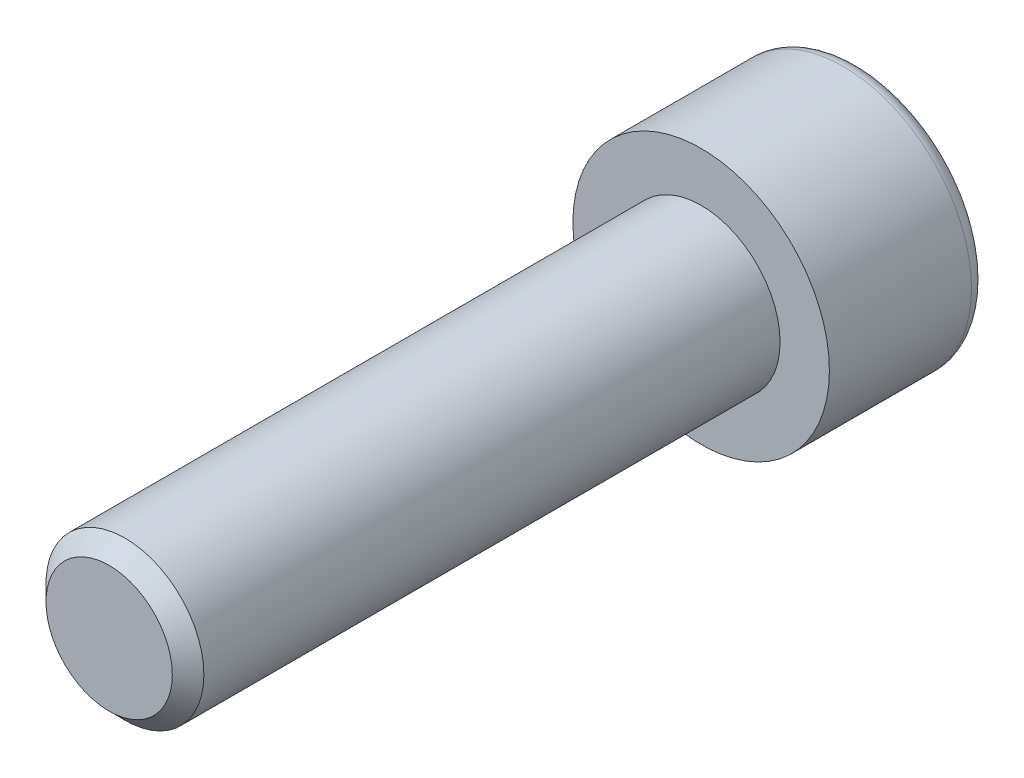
ISO-10303-21;
HEADER;
FILE_DESCRIPTION(('STEP AP214'),'2;1');
FILE_NAME('part.step','',(''),(''),'','','');
FILE_SCHEMA(('AUTOMOTIVE_DESIGN { 1 0 10303 214 1 1 1 1 }'));
ENDSEC;
DATA;
#1=APPLICATION_CONTEXT('core data for automotive mechanical design processes');
#2=APPLICATION_PROTOCOL_DEFINITION('international standard','automotive_design',2000,#1);
#3=PRODUCT_CONTEXT('',#1,'mechanical');
#4=PRODUCT('Part','Part','',(#3));
#5=PRODUCT_RELATED_PRODUCT_CATEGORY('part','',(#4));
#6=PRODUCT_DEFINITION_FORMATION('','',#4);
#7=PRODUCT_DEFINITION_CONTEXT('part definition',#1,'design');
#8=PRODUCT_DEFINITION('design','',#6,#7);
#9=PRODUCT_DEFINITION_SHAPE('','',#8);
#10=(LENGTH_UNIT() NAMED_UNIT(*) SI_UNIT(.MILLI.,.METRE.));
#11=(NAMED_UNIT(*) PLANE_ANGLE_UNIT() SI_UNIT($,.RADIAN.));
#12=(NAMED_UNIT(*) SI_UNIT($,.STERADIAN.) SOLID_ANGLE_UNIT());
#13=UNCERTAINTY_MEASURE_WITH_UNIT(LENGTH_MEASURE(1.E-05),#10,'distance_accuracy_value','');
#14=(GEOMETRIC_REPRESENTATION_CONTEXT(3) GLOBAL_UNCERTAINTY_ASSIGNED_CONTEXT((#13)) GLOBAL_UNIT_ASSIGNED_CONTEXT((#10,
#11,#12)) REPRESENTATION_CONTEXT('',''));
#15=CARTESIAN_POINT('',(0.,0.,0.));
#16=DIRECTION('',(0.,0.,1.));
#17=DIRECTION('',(1.,0.,0.));
#18=AXIS2_PLACEMENT_3D('',#15,#16,#17);
#19=CARTESIAN_POINT('',(0.,0.,-8.00000000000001));
#20=DIRECTION('',(0.,0.,1.));
#21=DIRECTION('',(1.00000000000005,0.,0.));
#22=AXIS2_PLACEMENT_3D('',#19,#20,#21);
#23=PLANE('',#22);
#24=CARTESIAN_POINT('',(0.,0.,-8.00000000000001));
#25=DIRECTION('',(0.,0.,-1.));
#26=DIRECTION('',(-1.00000000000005,0.,0.));
#27=AXIS2_PLACEMENT_3D('',#24,#25,#26);
#28=CIRCLE('',#27,5.7);
#29=CARTESIAN_POINT('',(-5.70000000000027,0.,-8.00000000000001));
#30=VERTEX_POINT('',#29);
#31=EDGE_CURVE('E145',#30,#30,#28,.T.);
#32=ORIENTED_EDGE('',*,*,#31,.T.);
#33=EDGE_LOOP('',(#32));
#34=FACE_BOUND('',#33,.T.);
#35=DIRECTION('',(-0.866025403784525,0.500000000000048,0.));
#36=VECTOR('',#35,1.);
#37=CARTESIAN_POINT('',(-1.52655665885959E-12,3.46410161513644,-8.00000000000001));
#38=LINE('',#37,#36);
#39=CARTESIAN_POINT('',(2.99999999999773,1.73205080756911,-8.00000000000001));
#40=VERTEX_POINT('',#39);
#41=CARTESIAN_POINT('',(-1.52655665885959E-12,3.46410161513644,-8.00000000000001));
#42=VERTEX_POINT('',#41);
#43=EDGE_CURVE('E49',#40,#42,#38,.T.);
#44=ORIENTED_EDGE('',*,*,#43,.T.);
#45=DIRECTION('',(-0.866025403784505,-0.500000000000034,0.));
#46=VECTOR('',#45,1.);
#47=CARTESIAN_POINT('',(-1.52655665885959E-12,3.46410161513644,-8.00000000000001));
#48=LINE('',#47,#46);
#49=CARTESIAN_POINT('',(-3.00000000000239,1.73205080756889,-8.00000000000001));
#50=VERTEX_POINT('',#49);
#51=EDGE_CURVE('E89',#42,#50,#48,.T.);
#52=ORIENTED_EDGE('',*,*,#51,.T.);
#53=DIRECTION('',(0.,-1.00000000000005,0.));
#54=VECTOR('',#53,1.);
#55=CARTESIAN_POINT('',(-3.00000000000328,-1.73205080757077,-8.00000000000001));
#56=LINE('',#55,#54);
#57=CARTESIAN_POINT('',(-3.00000000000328,-1.73205080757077,-8.00000000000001));
#58=VERTEX_POINT('',#57);
#59=EDGE_CURVE('E97',#50,#58,#56,.T.);
#60=ORIENTED_EDGE('',*,*,#59,.T.);
#61=DIRECTION('',(0.866025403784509,-0.500000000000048,0.));
#62=VECTOR('',#61,1.);
#63=CARTESIAN_POINT('',(-1.99840144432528E-12,-3.46410161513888,-8.00000000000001));
#64=LINE('',#63,#62);
#65=CARTESIAN_POINT('',(-1.99840144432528E-12,-3.46410161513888,-8.00000000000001));
#66=VERTEX_POINT('',#65);
#67=EDGE_CURVE('E115',#58,#66,#64,.T.);
#68=ORIENTED_EDGE('',*,*,#67,.T.);
#69=DIRECTION('',(0.866025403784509,0.500000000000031,0.));
#70=VECTOR('',#69,1.);
#71=CARTESIAN_POINT('',(-1.99840144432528E-12,-3.46410161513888,-8.00000000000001));
#72=LINE('',#71,#70);
#73=CARTESIAN_POINT('',(2.99999999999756,-1.732050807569,-8.00000000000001));
#74=VERTEX_POINT('',#73);
#75=EDGE_CURVE('E118',#66,#74,#72,.T.);
#76=ORIENTED_EDGE('',*,*,#75,.T.);
#77=DIRECTION('',(0.,1.00000000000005,0.));
#78=VECTOR('',#77,1.);
#79=CARTESIAN_POINT('',(2.99999999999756,-1.732050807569,-8.00000000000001));
#80=LINE('',#79,#78);
#81=EDGE_CURVE('E108',#74,#40,#80,.T.);
#82=ORIENTED_EDGE('',*,*,#81,.T.);
#83=EDGE_LOOP('',(#44,#52,#60,#68,#76,#82));
#84=FACE_BOUND('',#83,.T.);
#85=ADVANCED_FACE('F35',(#34,#84),#23,.F.);
#86=CARTESIAN_POINT('',(0.,0.,-7.19999999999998));
#87=DIRECTION('',(0.,0.,-1.));
#88=DIRECTION('',(-1.00000000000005,0.,0.));
#89=AXIS2_PLACEMENT_3D('',#86,#87,#88);
#90=TOROIDAL_SURFACE('',#89,5.7,0.8);
#91=ORIENTED_EDGE('',*,*,#31,.F.);
#92=EDGE_LOOP('',(#91));
#93=FACE_BOUND('',#92,.T.);
#94=CARTESIAN_POINT('',(0.,0.,-7.19999999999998));
#95=DIRECTION('',(0.,0.,-1.));
#96=DIRECTION('',(-1.00000000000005,0.,0.));
#97=AXIS2_PLACEMENT_3D('',#94,#95,#96);
#98=CIRCLE('',#97,6.5);
#99=CARTESIAN_POINT('',(-6.50000000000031,0.,-7.19999999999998));
#100=VERTEX_POINT('',#99);
#101=EDGE_CURVE('E142',#100,#100,#98,.T.);
#102=ORIENTED_EDGE('',*,*,#101,.T.);
#103=EDGE_LOOP('',(#102));
#104=FACE_BOUND('',#103,.T.);
#105=ADVANCED_FACE('F164',(#93,#104),#90,.T.);
#106=CARTESIAN_POINT('',(0.,0.,0.));
#107=DIRECTION('',(0.,0.,-1.));
#108=DIRECTION('',(-1.00000000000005,0.,0.));
#109=AXIS2_PLACEMENT_3D('',#106,#107,#108);
#110=CYLINDRICAL_SURFACE('',#109,6.5);
#111=ORIENTED_EDGE('',*,*,#101,.F.);
#112=EDGE_LOOP('',(#111));
#113=FACE_BOUND('',#112,.T.);
#114=CARTESIAN_POINT('',(0.,0.,0.));
#115=DIRECTION('',(0.,0.,-1.));
#116=DIRECTION('',(-1.00000000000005,0.,0.));
#117=AXIS2_PLACEMENT_3D('',#114,#115,#116);
#118=CIRCLE('',#117,6.5);
#119=CARTESIAN_POINT('',(-6.50000000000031,0.,0.));
#120=VERTEX_POINT('',#119);
#121=EDGE_CURVE('E103',#120,#120,#118,.T.);
#122=ORIENTED_EDGE('',*,*,#121,.T.);
#123=EDGE_LOOP('',(#122));
#124=FACE_BOUND('',#123,.T.);
#125=ADVANCED_FACE('F169',(#113,#124),#110,.T.);
#126=CARTESIAN_POINT('',(0.,0.,0.));
#127=DIRECTION('',(0.,0.,-1.));
#128=DIRECTION('',(-1.00000000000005,0.,0.));
#129=AXIS2_PLACEMENT_3D('',#126,#127,#128);
#130=PLANE('',#129);
#131=CARTESIAN_POINT('',(0.,0.,0.));
#132=DIRECTION('',(0.,0.,1.));
#133=DIRECTION('',(1.00000000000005,0.,0.));
#134=AXIS2_PLACEMENT_3D('',#131,#132,#133);
#135=CIRCLE('',#134,4.);
#136=CARTESIAN_POINT('',(4.00000000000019,0.,0.));
#137=VERTEX_POINT('',#136);
#138=EDGE_CURVE('E109',#137,#137,#135,.T.);
#139=ORIENTED_EDGE('',*,*,#138,.F.);
#140=EDGE_LOOP('',(#139));
#141=FACE_BOUND('',#140,.T.);
#142=ORIENTED_EDGE('',*,*,#121,.F.);
#143=EDGE_LOOP('',(#142));
#144=FACE_BOUND('',#143,.T.);
#145=ADVANCED_FACE('F177',(#141,#144),#130,.F.);
#146=CARTESIAN_POINT('',(-1.52655665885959E-12,3.46410161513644,-4.));
#147=DIRECTION('',(-0.500000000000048,-0.866025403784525,0.));
#148=DIRECTION('',(0.866025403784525,-0.500000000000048,0.));
#149=AXIS2_PLACEMENT_3D('',#146,#147,#148);
#150=PLANE('',#149);
#151=ORIENTED_EDGE('',*,*,#43,.F.);
#152=DIRECTION('',(0.,0.,-1.));
#153=VECTOR('',#152,1.);
#154=CARTESIAN_POINT('',(2.99999999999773,1.73205080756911,-4.));
#155=LINE('',#154,#153);
#156=CARTESIAN_POINT('',(2.99999999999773,1.73205080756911,-4.));
#157=VERTEX_POINT('',#156);
#158=EDGE_CURVE('E131',#157,#40,#155,.T.);
#159=ORIENTED_EDGE('',*,*,#158,.F.);
#160=DIRECTION('',(-0.866025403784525,0.500000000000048,0.));
#161=VECTOR('',#160,1.);
#162=CARTESIAN_POINT('',(-1.52655665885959E-12,3.46410161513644,-4.));
#163=LINE('',#162,#161);
#164=CARTESIAN_POINT('',(-1.52655665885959E-12,3.46410161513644,-4.));
#165=VERTEX_POINT('',#164);
#166=EDGE_CURVE('E102',#157,#165,#163,.T.);
#167=ORIENTED_EDGE('',*,*,#166,.T.);
#168=DIRECTION('',(0.,0.,-1.));
#169=VECTOR('',#168,1.);
#170=CARTESIAN_POINT('',(-1.52655665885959E-12,3.46410161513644,-4.));
#171=LINE('',#170,#169);
#172=EDGE_CURVE('E91',#165,#42,#171,.T.);
#173=ORIENTED_EDGE('',*,*,#172,.T.);
#174=EDGE_LOOP('',(#151,#159,#167,#173));
#175=FACE_BOUND('',#174,.T.);
#176=ADVANCED_FACE('F100',(#175),#150,.T.);
#177=CARTESIAN_POINT('',(-1.52655665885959E-12,3.46410161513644,-4.));
#178=DIRECTION('',(0.500000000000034,-0.866025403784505,0.));
#179=DIRECTION('',(0.866025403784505,0.500000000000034,0.));
#180=AXIS2_PLACEMENT_3D('',#177,#178,#179);
#181=PLANE('',#180);
#182=ORIENTED_EDGE('',*,*,#51,.F.);
#183=ORIENTED_EDGE('',*,*,#172,.F.);
#184=DIRECTION('',(-0.866025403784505,-0.500000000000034,0.));
#185=VECTOR('',#184,1.);
#186=CARTESIAN_POINT('',(-1.52655665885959E-12,3.46410161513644,-4.));
#187=LINE('',#186,#185);
#188=CARTESIAN_POINT('',(-3.00000000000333,1.73205080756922,-4.));
#189=VERTEX_POINT('',#188);
#190=EDGE_CURVE('E122',#165,#189,#187,.T.);
#191=ORIENTED_EDGE('',*,*,#190,.T.);
#192=DIRECTION('',(0.,0.,-1.));
#193=VECTOR('',#192,1.);
#194=CARTESIAN_POINT('',(-3.00000000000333,1.73205080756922,-4.));
#195=LINE('',#194,#193);
#196=EDGE_CURVE('E93',#189,#50,#195,.T.);
#197=ORIENTED_EDGE('',*,*,#196,.T.);
#198=EDGE_LOOP('',(#182,#183,#191,#197));
#199=FACE_BOUND('',#198,.T.);
#200=ADVANCED_FACE('F90',(#199),#181,.T.);
#201=CARTESIAN_POINT('',(-3.00000000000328,-1.73205080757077,-4.));
#202=DIRECTION('',(1.00000000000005,0.,0.));
#203=DIRECTION('',(0.,0.,-1.));
#204=AXIS2_PLACEMENT_3D('',#201,#202,#203);
#205=PLANE('',#204);
#206=ORIENTED_EDGE('',*,*,#59,.F.);
#207=ORIENTED_EDGE('',*,*,#196,.F.);
#208=DIRECTION('',(0.,-1.00000000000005,0.));
#209=VECTOR('',#208,1.);
#210=CARTESIAN_POINT('',(-3.00000000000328,-1.73205080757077,-4.));
#211=LINE('',#210,#209);
#212=CARTESIAN_POINT('',(-3.00000000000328,-1.73205080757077,-4.));
#213=VERTEX_POINT('',#212);
#214=EDGE_CURVE('E124',#189,#213,#211,.T.);
#215=ORIENTED_EDGE('',*,*,#214,.T.);
#216=DIRECTION('',(0.,0.,-1.));
#217=VECTOR('',#216,1.);
#218=CARTESIAN_POINT('',(-3.00000000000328,-1.73205080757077,-4.));
#219=LINE('',#218,#217);
#220=EDGE_CURVE('E137',#213,#58,#219,.T.);
#221=ORIENTED_EDGE('',*,*,#220,.T.);
#222=EDGE_LOOP('',(#206,#207,#215,#221));
#223=FACE_BOUND('',#222,.T.);
#224=ADVANCED_FACE('F192',(#223),#205,.T.);
#225=CARTESIAN_POINT('',(-1.99840144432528E-12,-3.46410161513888,-4.));
#226=DIRECTION('',(0.500000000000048,0.866025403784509,0.));
#227=DIRECTION('',(-0.866025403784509,0.500000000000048,0.));
#228=AXIS2_PLACEMENT_3D('',#225,#226,#227);
#229=PLANE('',#228);
#230=ORIENTED_EDGE('',*,*,#67,.F.);
#231=ORIENTED_EDGE('',*,*,#220,.F.);
#232=DIRECTION('',(0.866025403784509,-0.500000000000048,0.));
#233=VECTOR('',#232,1.);
#234=CARTESIAN_POINT('',(-1.99840144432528E-12,-3.46410161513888,-4.));
#235=LINE('',#234,#233);
#236=CARTESIAN_POINT('',(-1.99840144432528E-12,-3.46410161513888,-4.));
#237=VERTEX_POINT('',#236);
#238=EDGE_CURVE('E126',#213,#237,#235,.T.);
#239=ORIENTED_EDGE('',*,*,#238,.T.);
#240=DIRECTION('',(0.,0.,-1.));
#241=VECTOR('',#240,1.);
#242=CARTESIAN_POINT('',(-1.99840144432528E-12,-3.46410161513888,-4.));
#243=LINE('',#242,#241);
#244=EDGE_CURVE('E135',#237,#66,#243,.T.);
#245=ORIENTED_EDGE('',*,*,#244,.T.);
#246=EDGE_LOOP('',(#230,#231,#239,#245));
#247=FACE_BOUND('',#246,.T.);
#248=ADVANCED_FACE('F195',(#247),#229,.T.);
#249=CARTESIAN_POINT('',(-1.99840144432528E-12,-3.46410161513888,-4.));
#250=DIRECTION('',(-0.500000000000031,0.866025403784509,0.));
#251=DIRECTION('',(-0.866025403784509,-0.500000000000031,0.));
#252=AXIS2_PLACEMENT_3D('',#249,#250,#251);
#253=PLANE('',#252);
#254=ORIENTED_EDGE('',*,*,#75,.F.);
#255=ORIENTED_EDGE('',*,*,#244,.F.);
#256=DIRECTION('',(0.866025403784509,0.500000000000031,0.));
#257=VECTOR('',#256,1.);
#258=CARTESIAN_POINT('',(-1.99840144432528E-12,-3.46410161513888,-4.));
#259=LINE('',#258,#257);
#260=CARTESIAN_POINT('',(2.99999999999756,-1.732050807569,-4.));
#261=VERTEX_POINT('',#260);
#262=EDGE_CURVE('E128',#237,#261,#259,.T.);
#263=ORIENTED_EDGE('',*,*,#262,.T.);
#264=DIRECTION('',(0.,0.,-1.));
#265=VECTOR('',#264,1.);
#266=CARTESIAN_POINT('',(2.99999999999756,-1.732050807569,-4.));
#267=LINE('',#266,#265);
#268=EDGE_CURVE('E133',#261,#74,#267,.T.);
#269=ORIENTED_EDGE('',*,*,#268,.T.);
#270=EDGE_LOOP('',(#254,#255,#263,#269));
#271=FACE_BOUND('',#270,.T.);
#272=ADVANCED_FACE('F199',(#271),#253,.T.);
#273=CARTESIAN_POINT('',(2.99999999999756,-1.732050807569,-4.));
#274=DIRECTION('',(-1.00000000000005,0.,0.));
#275=DIRECTION('',(0.,0.,1.));
#276=AXIS2_PLACEMENT_3D('',#273,#274,#275);
#277=PLANE('',#276);
#278=ORIENTED_EDGE('',*,*,#81,.F.);
#279=ORIENTED_EDGE('',*,*,#268,.F.);
#280=DIRECTION('',(0.,1.00000000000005,0.));
#281=VECTOR('',#280,1.);
#282=CARTESIAN_POINT('',(2.99999999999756,-1.732050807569,-4.));
#283=LINE('',#282,#281);
#284=EDGE_CURVE('E56',#261,#157,#283,.T.);
#285=ORIENTED_EDGE('',*,*,#284,.T.);
#286=ORIENTED_EDGE('',*,*,#158,.T.);
#287=EDGE_LOOP('',(#278,#279,#285,#286));
#288=FACE_BOUND('',#287,.T.);
#289=ADVANCED_FACE('F203',(#288),#277,.T.);
#290=CARTESIAN_POINT('',(2.99999999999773,1.73205080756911,-4.));
#291=DIRECTION('',(0.,0.,1.));
#292=DIRECTION('',(1.00000000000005,0.,0.));
#293=AXIS2_PLACEMENT_3D('',#290,#291,#292);
#294=PLANE('',#293);
#295=ORIENTED_EDGE('',*,*,#166,.F.);
#296=ORIENTED_EDGE('',*,*,#284,.F.);
#297=ORIENTED_EDGE('',*,*,#262,.F.);
#298=ORIENTED_EDGE('',*,*,#238,.F.);
#299=ORIENTED_EDGE('',*,*,#214,.F.);
#300=ORIENTED_EDGE('',*,*,#190,.F.);
#301=EDGE_LOOP('',(#295,#296,#297,#298,#299,#300));
#302=FACE_BOUND('',#301,.T.);
#303=ADVANCED_FACE('F207',(#302),#294,.F.);
#304=CARTESIAN_POINT('',(0.,0.,30.));
#305=DIRECTION('',(0.,0.,1.));
#306=DIRECTION('',(1.00000000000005,0.,0.));
#307=AXIS2_PLACEMENT_3D('',#304,#305,#306);
#308=PLANE('',#307);
#309=CARTESIAN_POINT('',(0.,0.,30.));
#310=DIRECTION('',(0.,0.,1.));
#311=DIRECTION('',(1.00000000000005,0.,0.));
#312=AXIS2_PLACEMENT_3D('',#309,#310,#311);
#313=CIRCLE('',#312,3.20000000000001);
#314=CARTESIAN_POINT('',(3.20000000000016,0.,30.));
#315=VERTEX_POINT('',#314);
#316=EDGE_CURVE('E42',#315,#315,#313,.T.);
#317=ORIENTED_EDGE('',*,*,#316,.T.);
#318=EDGE_LOOP('',(#317));
#319=FACE_BOUND('',#318,.T.);
#320=ADVANCED_FACE('F150',(#319),#308,.T.);
#321=CARTESIAN_POINT('',(0.,0.,0.));
#322=DIRECTION('',(0.,0.,1.));
#323=DIRECTION('',(1.00000000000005,0.,0.));
#324=AXIS2_PLACEMENT_3D('',#321,#322,#323);
#325=CYLINDRICAL_SURFACE('',#324,4.);
#326=CARTESIAN_POINT('',(0.,0.,29.2));
#327=DIRECTION('',(0.,0.,1.));
#328=DIRECTION('',(1.00000000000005,0.,0.));
#329=AXIS2_PLACEMENT_3D('',#326,#327,#328);
#330=CIRCLE('',#329,4.);
#331=CARTESIAN_POINT('',(4.00000000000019,0.,29.2));
#332=VERTEX_POINT('',#331);
#333=EDGE_CURVE('E11',#332,#332,#330,.F.);
#334=ORIENTED_EDGE('',*,*,#333,.T.);
#335=EDGE_LOOP('',(#334));
#336=FACE_BOUND('',#335,.T.);
#337=ORIENTED_EDGE('',*,*,#138,.T.);
#338=EDGE_LOOP('',(#337));
#339=FACE_BOUND('',#338,.T.);
#340=ADVANCED_FACE('F154',(#336,#339),#325,.T.);
#341=CARTESIAN_POINT('',(0.,0.,30.));
#342=DIRECTION('',(0.,0.,-1.));
#343=DIRECTION('',(-1.00000000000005,0.,0.));
#344=AXIS2_PLACEMENT_3D('',#341,#342,#343);
#345=CONICAL_SURFACE('',#344,3.20000000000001,0.785398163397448);
#346=ORIENTED_EDGE('',*,*,#333,.F.);
#347=EDGE_LOOP('',(#346));
#348=FACE_BOUND('',#347,.T.);
#349=ORIENTED_EDGE('',*,*,#316,.F.);
#350=EDGE_LOOP('',(#349));
#351=FACE_BOUND('',#350,.T.);
#352=ADVANCED_FACE('F152',(#348,#351),#345,.T.);
#353=CLOSED_SHELL('',(#85,#105,#125,#145,#176,#200,#224,#248,#272,#289,#303,#320,#340,#352));
#354=MANIFOLD_SOLID_BREP('B2',#353);
#355=ADVANCED_BREP_SHAPE_REPRESENTATION('',(#18,#354),#14);
#356=SHAPE_DEFINITION_REPRESENTATION(#9,#355);
ENDSEC;
END-ISO-10303-21;
